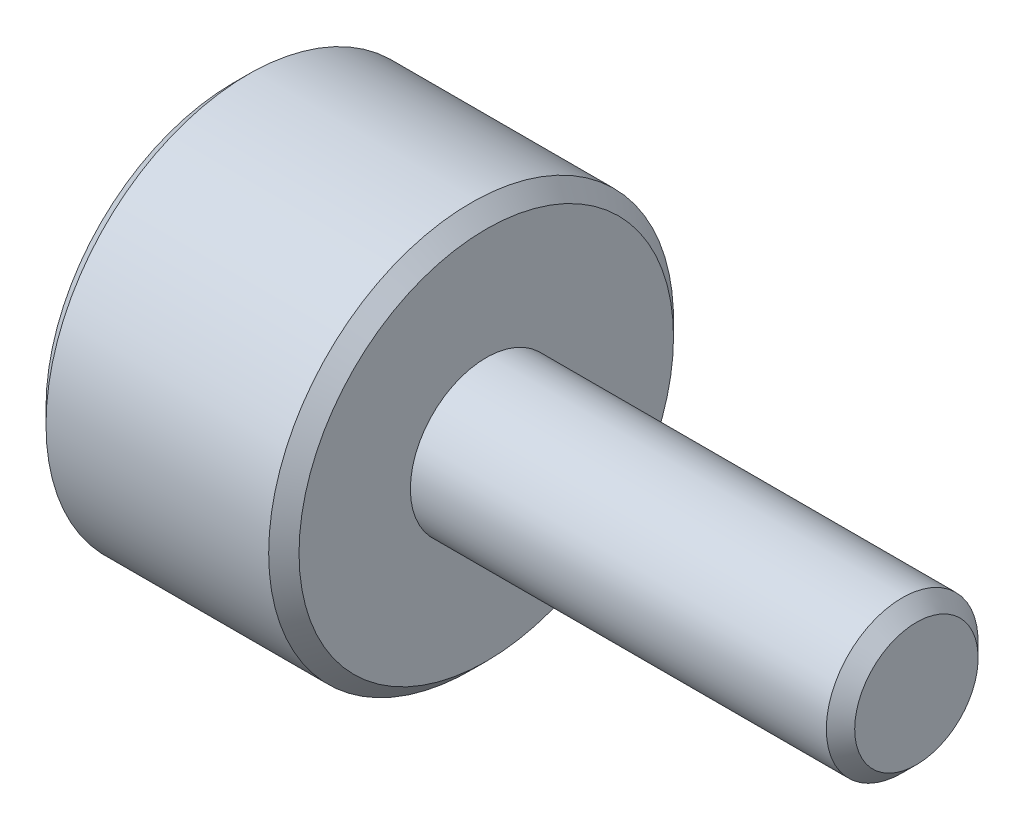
ISO-10303-21;
HEADER;
FILE_DESCRIPTION(('STEP AP214'),'2;1');
FILE_NAME('part.step','',(''),(''),'','','');
FILE_SCHEMA(('AUTOMOTIVE_DESIGN { 1 0 10303 214 1 1 1 1 }'));
ENDSEC;
DATA;
#1=APPLICATION_CONTEXT('core data for automotive mechanical design processes');
#2=APPLICATION_PROTOCOL_DEFINITION('international standard','automotive_design',2000,#1);
#3=PRODUCT_CONTEXT('',#1,'mechanical');
#4=PRODUCT('Part','Part','',(#3));
#5=PRODUCT_RELATED_PRODUCT_CATEGORY('part','',(#4));
#6=PRODUCT_DEFINITION_FORMATION('','',#4);
#7=PRODUCT_DEFINITION_CONTEXT('part definition',#1,'design');
#8=PRODUCT_DEFINITION('design','',#6,#7);
#9=PRODUCT_DEFINITION_SHAPE('','',#8);
#10=(LENGTH_UNIT() NAMED_UNIT(*) SI_UNIT(.MILLI.,.METRE.));
#11=(NAMED_UNIT(*) PLANE_ANGLE_UNIT() SI_UNIT($,.RADIAN.));
#12=(NAMED_UNIT(*) SI_UNIT($,.STERADIAN.) SOLID_ANGLE_UNIT());
#13=UNCERTAINTY_MEASURE_WITH_UNIT(LENGTH_MEASURE(1.E-05),#10,'distance_accuracy_value','');
#14=(GEOMETRIC_REPRESENTATION_CONTEXT(3) GLOBAL_UNCERTAINTY_ASSIGNED_CONTEXT((#13)) GLOBAL_UNIT_ASSIGNED_CONTEXT((#10,
#11,#12)) REPRESENTATION_CONTEXT('',''));
#15=CARTESIAN_POINT('',(0.,0.,0.));
#16=DIRECTION('',(0.,0.,1.));
#17=DIRECTION('',(1.,0.,0.));
#18=AXIS2_PLACEMENT_3D('',#15,#16,#17);
#19=CARTESIAN_POINT('',(-25.4,0.,0.));
#20=DIRECTION('',(-1.,0.,0.));
#21=DIRECTION('',(0.,0.,1.));
#22=AXIS2_PLACEMENT_3D('',#19,#20,#21);
#23=CYLINDRICAL_SURFACE('',#22,1.5);
#24=CARTESIAN_POINT('',(13.2195,0.,0.));
#25=DIRECTION('',(-1.,0.,0.));
#26=DIRECTION('',(0.,0.,1.));
#27=AXIS2_PLACEMENT_3D('',#24,#25,#26);
#28=CIRCLE('',#27,1.5);
#29=CARTESIAN_POINT('',(13.2195,0.,1.5));
#30=VERTEX_POINT('',#29);
#31=EDGE_CURVE('E10',#30,#30,#28,.T.);
#32=ORIENTED_EDGE('',*,*,#31,.T.);
#33=EDGE_LOOP('',(#32));
#34=FACE_BOUND('',#33,.T.);
#35=CARTESIAN_POINT('',(5.,0.,0.));
#36=DIRECTION('',(-1.,0.,0.));
#37=DIRECTION('',(0.,0.,1.));
#38=AXIS2_PLACEMENT_3D('',#35,#36,#37);
#39=CIRCLE('',#38,1.5);
#40=CARTESIAN_POINT('',(5.,0.,1.5));
#41=VERTEX_POINT('',#40);
#42=EDGE_CURVE('E57',#41,#41,#39,.T.);
#43=ORIENTED_EDGE('',*,*,#42,.F.);
#44=EDGE_LOOP('',(#43));
#45=FACE_BOUND('',#44,.T.);
#46=ADVANCED_FACE('F32',(#34,#45),#23,.T.);
#47=CARTESIAN_POINT('',(13.2195,0.,0.));
#48=DIRECTION('',(-1.,0.,0.));
#49=DIRECTION('',(0.,0.,1.));
#50=AXIS2_PLACEMENT_3D('',#47,#48,#49);
#51=CONICAL_SURFACE('',#50,1.5,0.785398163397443);
#52=CARTESIAN_POINT('',(13.5,0.,0.));
#53=DIRECTION('',(-1.,0.,0.));
#54=DIRECTION('',(0.,0.,1.));
#55=AXIS2_PLACEMENT_3D('',#52,#53,#54);
#56=CIRCLE('',#55,1.2195);
#57=CARTESIAN_POINT('',(13.5,0.,1.2195));
#58=VERTEX_POINT('',#57);
#59=EDGE_CURVE('E38',#58,#58,#56,.T.);
#60=ORIENTED_EDGE('',*,*,#59,.T.);
#61=EDGE_LOOP('',(#60));
#62=FACE_BOUND('',#61,.T.);
#63=ORIENTED_EDGE('',*,*,#31,.F.);
#64=EDGE_LOOP('',(#63));
#65=FACE_BOUND('',#64,.T.);
#66=ADVANCED_FACE('F64',(#62,#65),#51,.T.);
#67=CARTESIAN_POINT('',(13.5,1.2195,0.));
#68=DIRECTION('',(1.,0.,0.));
#69=DIRECTION('',(0.,0.,-1.));
#70=AXIS2_PLACEMENT_3D('',#67,#68,#69);
#71=PLANE('',#70);
#72=ORIENTED_EDGE('',*,*,#59,.F.);
#73=EDGE_LOOP('',(#72));
#74=FACE_BOUND('',#73,.T.);
#75=ADVANCED_FACE('F68',(#74),#71,.T.);
#76=CARTESIAN_POINT('',(0.,0.,0.));
#77=DIRECTION('',(-1.,0.,0.));
#78=DIRECTION('',(0.,0.,1.));
#79=AXIS2_PLACEMENT_3D('',#76,#77,#78);
#80=PLANE('',#79);
#81=CARTESIAN_POINT('',(0.,0.,0.));
#82=DIRECTION('',(-1.,0.,0.));
#83=DIRECTION('',(0.,0.,1.));
#84=AXIS2_PLACEMENT_3D('',#81,#82,#83);
#85=CIRCLE('',#84,3.7);
#86=CARTESIAN_POINT('',(0.,0.,3.7));
#87=VERTEX_POINT('',#86);
#88=EDGE_CURVE('E42',#87,#87,#85,.T.);
#89=ORIENTED_EDGE('',*,*,#88,.T.);
#90=EDGE_LOOP('',(#89));
#91=FACE_BOUND('',#90,.T.);
#92=ADVANCED_FACE('F72',(#91),#80,.T.);
#93=CARTESIAN_POINT('',(0.299999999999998,0.,0.));
#94=DIRECTION('',(1.,0.,0.));
#95=DIRECTION('',(0.,0.,-1.));
#96=AXIS2_PLACEMENT_3D('',#93,#94,#95);
#97=CONICAL_SURFACE('',#96,4.,0.785398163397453);
#98=ORIENTED_EDGE('',*,*,#88,.F.);
#99=EDGE_LOOP('',(#98));
#100=FACE_BOUND('',#99,.T.);
#101=CARTESIAN_POINT('',(0.299999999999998,0.,0.));
#102=DIRECTION('',(-1.,0.,0.));
#103=DIRECTION('',(0.,0.,1.));
#104=AXIS2_PLACEMENT_3D('',#101,#102,#103);
#105=CIRCLE('',#104,4.);
#106=CARTESIAN_POINT('',(0.299999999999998,0.,4.));
#107=VERTEX_POINT('',#106);
#108=EDGE_CURVE('E46',#107,#107,#105,.T.);
#109=ORIENTED_EDGE('',*,*,#108,.T.);
#110=EDGE_LOOP('',(#109));
#111=FACE_BOUND('',#110,.T.);
#112=ADVANCED_FACE('F79',(#100,#111),#97,.T.);
#113=CARTESIAN_POINT('',(-25.4,0.,0.));
#114=DIRECTION('',(-1.,0.,0.));
#115=DIRECTION('',(0.,0.,1.));
#116=AXIS2_PLACEMENT_3D('',#113,#114,#115);
#117=CYLINDRICAL_SURFACE('',#116,4.);
#118=CARTESIAN_POINT('',(4.7,0.,0.));
#119=DIRECTION('',(-1.,0.,0.));
#120=DIRECTION('',(0.,0.,1.));
#121=AXIS2_PLACEMENT_3D('',#118,#119,#120);
#122=CIRCLE('',#121,4.);
#123=CARTESIAN_POINT('',(4.7,0.,4.));
#124=VERTEX_POINT('',#123);
#125=EDGE_CURVE('E51',#124,#124,#122,.T.);
#126=ORIENTED_EDGE('',*,*,#125,.T.);
#127=EDGE_LOOP('',(#126));
#128=FACE_BOUND('',#127,.T.);
#129=ORIENTED_EDGE('',*,*,#108,.F.);
#130=EDGE_LOOP('',(#129));
#131=FACE_BOUND('',#130,.T.);
#132=ADVANCED_FACE('F83',(#128,#131),#117,.T.);
#133=CARTESIAN_POINT('',(4.7,0.,0.));
#134=DIRECTION('',(-1.,0.,0.));
#135=DIRECTION('',(0.,0.,1.));
#136=AXIS2_PLACEMENT_3D('',#133,#134,#135);
#137=CONICAL_SURFACE('',#136,4.,0.785398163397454);
#138=CARTESIAN_POINT('',(5.,0.,0.));
#139=DIRECTION('',(-1.,0.,0.));
#140=DIRECTION('',(0.,0.,1.));
#141=AXIS2_PLACEMENT_3D('',#138,#139,#140);
#142=CIRCLE('',#141,3.7);
#143=CARTESIAN_POINT('',(5.,0.,3.7));
#144=VERTEX_POINT('',#143);
#145=EDGE_CURVE('E54',#144,#144,#142,.T.);
#146=ORIENTED_EDGE('',*,*,#145,.T.);
#147=EDGE_LOOP('',(#146));
#148=FACE_BOUND('',#147,.T.);
#149=ORIENTED_EDGE('',*,*,#125,.F.);
#150=EDGE_LOOP('',(#149));
#151=FACE_BOUND('',#150,.T.);
#152=ADVANCED_FACE('F87',(#148,#151),#137,.T.);
#153=CARTESIAN_POINT('',(5.,1.5,0.));
#154=DIRECTION('',(-1.,0.,0.));
#155=DIRECTION('',(0.,0.,1.));
#156=AXIS2_PLACEMENT_3D('',#153,#154,#155);
#157=PLANE('',#156);
#158=ORIENTED_EDGE('',*,*,#145,.F.);
#159=EDGE_LOOP('',(#158));
#160=FACE_BOUND('',#159,.T.);
#161=ORIENTED_EDGE('',*,*,#42,.T.);
#162=EDGE_LOOP('',(#161));
#163=FACE_BOUND('',#162,.T.);
#164=ADVANCED_FACE('F61',(#160,#163),#157,.F.);
#165=CLOSED_SHELL('',(#46,#66,#75,#92,#112,#132,#152,#164));
#166=MANIFOLD_SOLID_BREP('B2',#165);
#167=ADVANCED_BREP_SHAPE_REPRESENTATION('',(#18,#166),#14);
#168=SHAPE_DEFINITION_REPRESENTATION(#9,#167);
ENDSEC;
END-ISO-10303-21;
